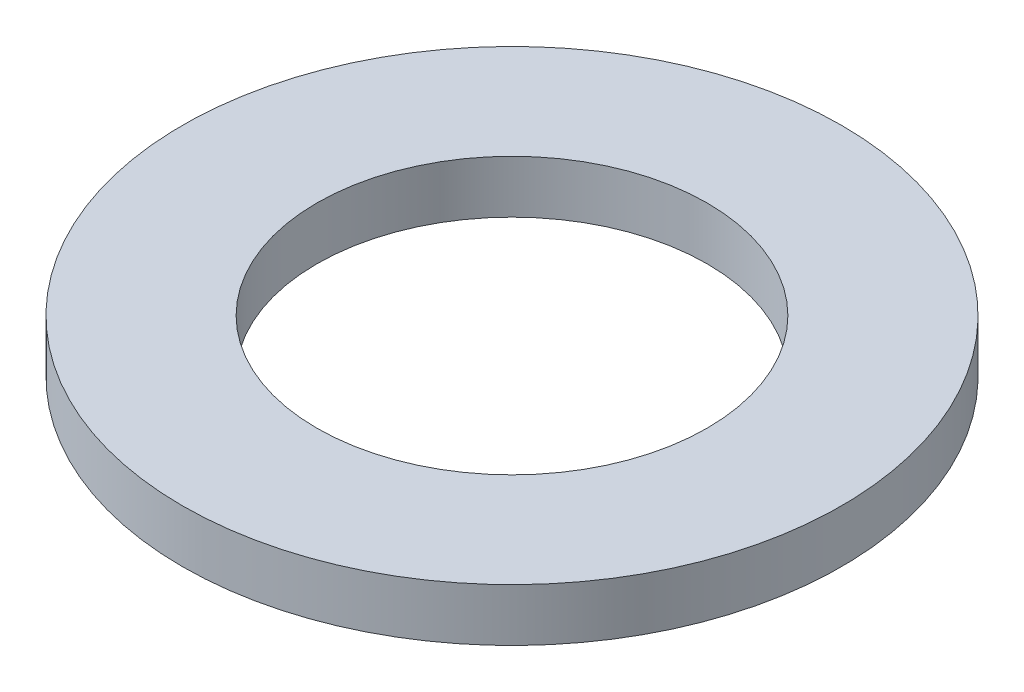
from build123d import *

# Parameters (mm, degrees)
SKETCH1_R      = 62.5
SKETCH1_R_2    = 37
EXTRUDE1_DEPTH = 10


with BuildPart() as part:
    # Sketch1 → Extrude1 (new body)
    with BuildSketch(Plane(origin=(0, 0, 0), x_dir=(1, 0, 0), z_dir=(0, 1, 0))):
        with Locations(Location((0, 0, 0), (0, 0, 270))):
            Circle(SKETCH1_R)
        with Locations(Location((0, 0, 0), (0, 0, 270))):
            Circle(SKETCH1_R_2, mode=Mode.SUBTRACT)
    extrude(amount=EXTRUDE1_DEPTH)


solid = part.part
